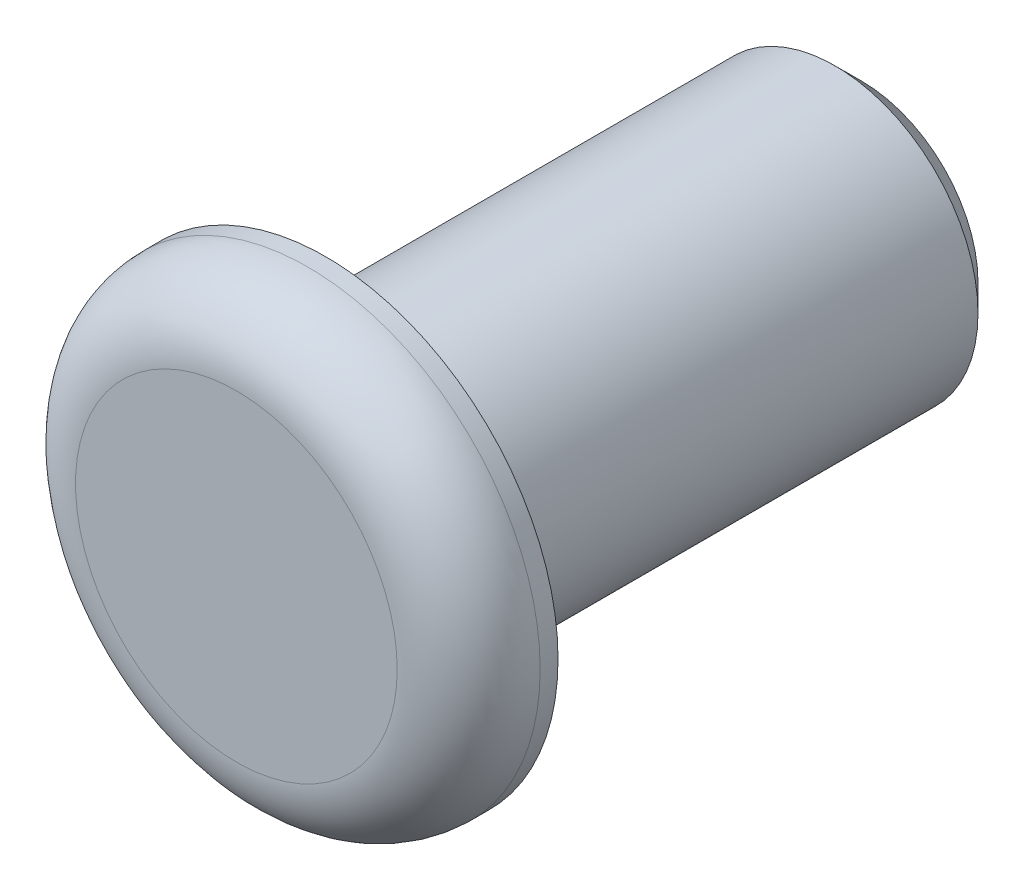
ISO-10303-21;
HEADER;
FILE_DESCRIPTION(('STEP AP214'),'2;1');
FILE_NAME('part.step','',(''),(''),'','','');
FILE_SCHEMA(('AUTOMOTIVE_DESIGN { 1 0 10303 214 1 1 1 1 }'));
ENDSEC;
DATA;
#1=APPLICATION_CONTEXT('core data for automotive mechanical design processes');
#2=APPLICATION_PROTOCOL_DEFINITION('international standard','automotive_design',2000,#1);
#3=PRODUCT_CONTEXT('',#1,'mechanical');
#4=PRODUCT('Part','Part','',(#3));
#5=PRODUCT_RELATED_PRODUCT_CATEGORY('part','',(#4));
#6=PRODUCT_DEFINITION_FORMATION('','',#4);
#7=PRODUCT_DEFINITION_CONTEXT('part definition',#1,'design');
#8=PRODUCT_DEFINITION('design','',#6,#7);
#9=PRODUCT_DEFINITION_SHAPE('','',#8);
#10=(LENGTH_UNIT() NAMED_UNIT(*) SI_UNIT(.MILLI.,.METRE.));
#11=(NAMED_UNIT(*) PLANE_ANGLE_UNIT() SI_UNIT($,.RADIAN.));
#12=(NAMED_UNIT(*) SI_UNIT($,.STERADIAN.) SOLID_ANGLE_UNIT());
#13=UNCERTAINTY_MEASURE_WITH_UNIT(LENGTH_MEASURE(1.E-05),#10,'distance_accuracy_value','');
#14=(GEOMETRIC_REPRESENTATION_CONTEXT(3) GLOBAL_UNCERTAINTY_ASSIGNED_CONTEXT((#13)) GLOBAL_UNIT_ASSIGNED_CONTEXT((#10,
#11,#12)) REPRESENTATION_CONTEXT('',''));
#15=CARTESIAN_POINT('',(0.,0.,0.));
#16=DIRECTION('',(0.,0.,1.));
#17=DIRECTION('',(1.,0.,0.));
#18=AXIS2_PLACEMENT_3D('',#15,#16,#17);
#19=CARTESIAN_POINT('',(0.,0.,2.5));
#20=DIRECTION('',(0.,0.,-1.));
#21=DIRECTION('',(-1.,0.,0.));
#22=AXIS2_PLACEMENT_3D('',#19,#20,#21);
#23=CYLINDRICAL_SURFACE('',#22,6.5);
#24=CARTESIAN_POINT('',(0.,0.,0.5));
#25=DIRECTION('',(0.,0.,1.));
#26=DIRECTION('',(1.,0.,0.));
#27=AXIS2_PLACEMENT_3D('',#24,#25,#26);
#28=CIRCLE('',#27,6.5);
#29=CARTESIAN_POINT('',(6.5,0.,0.5));
#30=VERTEX_POINT('',#29);
#31=EDGE_CURVE('E10',#30,#30,#28,.F.);
#32=ORIENTED_EDGE('',*,*,#31,.T.);
#33=EDGE_LOOP('',(#32));
#34=FACE_BOUND('',#33,.T.);
#35=CARTESIAN_POINT('',(0.,0.,0.));
#36=DIRECTION('',(0.,0.,1.));
#37=DIRECTION('',(1.,0.,0.));
#38=AXIS2_PLACEMENT_3D('',#35,#36,#37);
#39=CIRCLE('',#38,6.5);
#40=CARTESIAN_POINT('',(6.5,0.,0.));
#41=VERTEX_POINT('',#40);
#42=EDGE_CURVE('E56',#41,#41,#39,.T.);
#43=ORIENTED_EDGE('',*,*,#42,.T.);
#44=EDGE_LOOP('',(#43));
#45=FACE_BOUND('',#44,.T.);
#46=ADVANCED_FACE('F35',(#34,#45),#23,.T.);
#47=CARTESIAN_POINT('',(0.,0.,2.5));
#48=DIRECTION('',(0.,0.,1.));
#49=DIRECTION('',(1.,0.,0.));
#50=AXIS2_PLACEMENT_3D('',#47,#48,#49);
#51=PLANE('',#50);
#52=CARTESIAN_POINT('',(0.,0.,2.5));
#53=DIRECTION('',(0.,0.,1.));
#54=DIRECTION('',(1.,0.,0.));
#55=AXIS2_PLACEMENT_3D('',#52,#53,#54);
#56=CIRCLE('',#55,4.5);
#57=CARTESIAN_POINT('',(4.5,0.,2.5));
#58=VERTEX_POINT('',#57);
#59=EDGE_CURVE('E42',#58,#58,#56,.T.);
#60=ORIENTED_EDGE('',*,*,#59,.T.);
#61=EDGE_LOOP('',(#60));
#62=FACE_BOUND('',#61,.T.);
#63=ADVANCED_FACE('F67',(#62),#51,.T.);
#64=CARTESIAN_POINT('',(0.,0.,0.));
#65=DIRECTION('',(0.,0.,1.));
#66=DIRECTION('',(1.,0.,0.));
#67=AXIS2_PLACEMENT_3D('',#64,#65,#66);
#68=PLANE('',#67);
#69=CARTESIAN_POINT('',(0.,0.,0.));
#70=DIRECTION('',(0.,0.,-1.));
#71=DIRECTION('',(-1.,0.,0.));
#72=AXIS2_PLACEMENT_3D('',#69,#70,#71);
#73=CIRCLE('',#72,4.);
#74=CARTESIAN_POINT('',(-4.,0.,0.));
#75=VERTEX_POINT('',#74);
#76=EDGE_CURVE('E55',#75,#75,#73,.T.);
#77=ORIENTED_EDGE('',*,*,#76,.F.);
#78=EDGE_LOOP('',(#77));
#79=FACE_BOUND('',#78,.T.);
#80=ORIENTED_EDGE('',*,*,#42,.F.);
#81=EDGE_LOOP('',(#80));
#82=FACE_BOUND('',#81,.T.);
#83=ADVANCED_FACE('F64',(#79,#82),#68,.F.);
#84=CARTESIAN_POINT('',(0.,0.,-15.));
#85=DIRECTION('',(0.,0.,1.));
#86=DIRECTION('',(1.,0.,0.));
#87=AXIS2_PLACEMENT_3D('',#84,#85,#86);
#88=CYLINDRICAL_SURFACE('',#87,4.);
#89=CARTESIAN_POINT('',(0.,0.,-14.25));
#90=DIRECTION('',(0.,0.,-1.));
#91=DIRECTION('',(-1.,0.,0.));
#92=AXIS2_PLACEMENT_3D('',#89,#90,#91);
#93=CIRCLE('',#92,4.);
#94=CARTESIAN_POINT('',(-4.,0.,-14.25));
#95=VERTEX_POINT('',#94);
#96=EDGE_CURVE('E46',#95,#95,#93,.F.);
#97=ORIENTED_EDGE('',*,*,#96,.T.);
#98=EDGE_LOOP('',(#97));
#99=FACE_BOUND('',#98,.T.);
#100=ORIENTED_EDGE('',*,*,#76,.T.);
#101=EDGE_LOOP('',(#100));
#102=FACE_BOUND('',#101,.T.);
#103=ADVANCED_FACE('F62',(#99,#102),#88,.T.);
#104=CARTESIAN_POINT('',(0.,0.,-15.));
#105=DIRECTION('',(0.,0.,-1.));
#106=DIRECTION('',(-1.,0.,0.));
#107=AXIS2_PLACEMENT_3D('',#104,#105,#106);
#108=PLANE('',#107);
#109=CARTESIAN_POINT('',(0.,0.,-15.));
#110=DIRECTION('',(0.,0.,-1.));
#111=DIRECTION('',(-1.,0.,0.));
#112=AXIS2_PLACEMENT_3D('',#109,#110,#111);
#113=CIRCLE('',#112,3.24999999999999);
#114=CARTESIAN_POINT('',(-3.24999999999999,0.,-15.));
#115=VERTEX_POINT('',#114);
#116=EDGE_CURVE('E50',#115,#115,#113,.T.);
#117=ORIENTED_EDGE('',*,*,#116,.T.);
#118=EDGE_LOOP('',(#117));
#119=FACE_BOUND('',#118,.T.);
#120=ADVANCED_FACE('F82',(#119),#108,.T.);
#121=CARTESIAN_POINT('',(0.,0.,-15.));
#122=DIRECTION('',(0.,0.,1.));
#123=DIRECTION('',(1.,0.,0.));
#124=AXIS2_PLACEMENT_3D('',#121,#122,#123);
#125=CONICAL_SURFACE('',#124,3.24999999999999,0.785398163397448);
#126=ORIENTED_EDGE('',*,*,#96,.F.);
#127=EDGE_LOOP('',(#126));
#128=FACE_BOUND('',#127,.T.);
#129=ORIENTED_EDGE('',*,*,#116,.F.);
#130=EDGE_LOOP('',(#129));
#131=FACE_BOUND('',#130,.T.);
#132=ADVANCED_FACE('F78',(#128,#131),#125,.T.);
#133=CARTESIAN_POINT('',(0.,0.,0.5));
#134=DIRECTION('',(0.,0.,1.));
#135=DIRECTION('',(1.,0.,0.));
#136=AXIS2_PLACEMENT_3D('',#133,#134,#135);
#137=TOROIDAL_SURFACE('',#136,4.5,2.);
#138=ORIENTED_EDGE('',*,*,#31,.F.);
#139=EDGE_LOOP('',(#138));
#140=FACE_BOUND('',#139,.T.);
#141=ORIENTED_EDGE('',*,*,#59,.F.);
#142=EDGE_LOOP('',(#141));
#143=FACE_BOUND('',#142,.T.);
#144=ADVANCED_FACE('F37',(#140,#143),#137,.T.);
#145=CLOSED_SHELL('',(#46,#63,#83,#103,#120,#132,#144));
#146=MANIFOLD_SOLID_BREP('B2',#145);
#147=ADVANCED_BREP_SHAPE_REPRESENTATION('',(#18,#146),#14);
#148=SHAPE_DEFINITION_REPRESENTATION(#9,#147);
ENDSEC;
END-ISO-10303-21;
